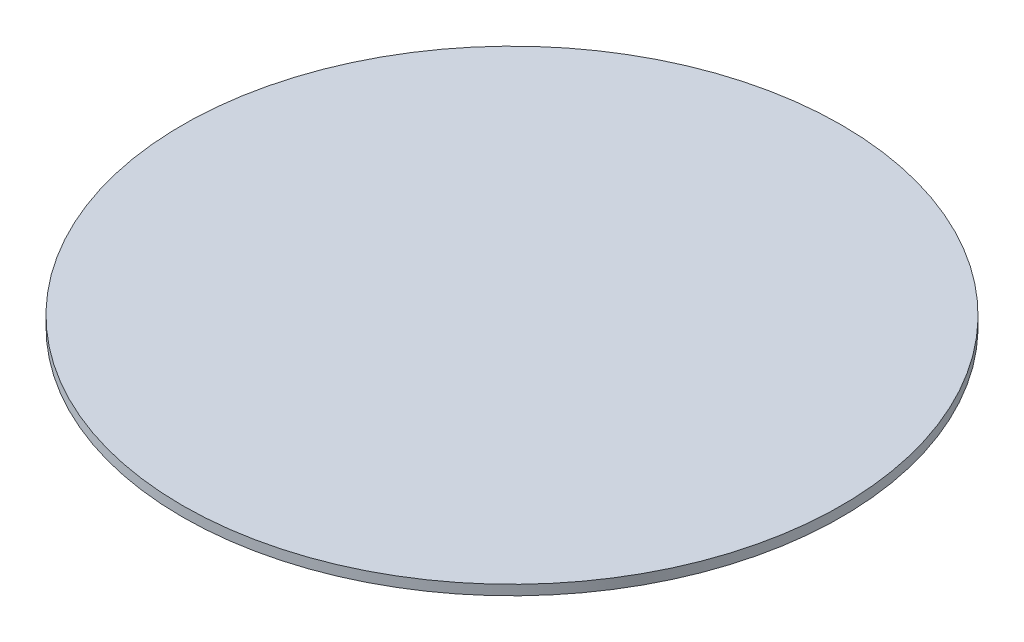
ISO-10303-21;
HEADER;
FILE_DESCRIPTION(('STEP AP214'),'2;1');
FILE_NAME('part.step','',(''),(''),'','','');
FILE_SCHEMA(('AUTOMOTIVE_DESIGN { 1 0 10303 214 1 1 1 1 }'));
ENDSEC;
DATA;
#1=APPLICATION_CONTEXT('core data for automotive mechanical design processes');
#2=APPLICATION_PROTOCOL_DEFINITION('international standard','automotive_design',2000,#1);
#3=PRODUCT_CONTEXT('',#1,'mechanical');
#4=PRODUCT('Part','Part','',(#3));
#5=PRODUCT_RELATED_PRODUCT_CATEGORY('part','',(#4));
#6=PRODUCT_DEFINITION_FORMATION('','',#4);
#7=PRODUCT_DEFINITION_CONTEXT('part definition',#1,'design');
#8=PRODUCT_DEFINITION('design','',#6,#7);
#9=PRODUCT_DEFINITION_SHAPE('','',#8);
#10=(LENGTH_UNIT() NAMED_UNIT(*) SI_UNIT(.MILLI.,.METRE.));
#11=(NAMED_UNIT(*) PLANE_ANGLE_UNIT() SI_UNIT($,.RADIAN.));
#12=(NAMED_UNIT(*) SI_UNIT($,.STERADIAN.) SOLID_ANGLE_UNIT());
#13=UNCERTAINTY_MEASURE_WITH_UNIT(LENGTH_MEASURE(1.E-05),#10,'distance_accuracy_value','');
#14=(GEOMETRIC_REPRESENTATION_CONTEXT(3) GLOBAL_UNCERTAINTY_ASSIGNED_CONTEXT((#13)) GLOBAL_UNIT_ASSIGNED_CONTEXT((#10,
#11,#12)) REPRESENTATION_CONTEXT('',''));
#15=CARTESIAN_POINT('',(0.,0.,0.));
#16=DIRECTION('',(0.,0.,1.));
#17=DIRECTION('',(1.,0.,0.));
#18=AXIS2_PLACEMENT_3D('',#15,#16,#17);
#19=CARTESIAN_POINT('',(0.,25.4,0.));
#20=DIRECTION('',(0.,-1.,0.));
#21=DIRECTION('',(0.,0.,-1.));
#22=AXIS2_PLACEMENT_3D('',#19,#20,#21);
#23=CYLINDRICAL_SURFACE('',#22,838.2);
#24=CARTESIAN_POINT('',(0.,25.4,0.));
#25=DIRECTION('',(0.,1.,0.));
#26=DIRECTION('',(0.,0.,1.));
#27=AXIS2_PLACEMENT_3D('',#24,#25,#26);
#28=CIRCLE('',#27,838.2);
#29=CARTESIAN_POINT('',(0.,25.4,838.2));
#30=VERTEX_POINT('',#29);
#31=EDGE_CURVE('E10',#30,#30,#28,.T.);
#32=ORIENTED_EDGE('',*,*,#31,.F.);
#33=EDGE_LOOP('',(#32));
#34=FACE_BOUND('',#33,.T.);
#35=CARTESIAN_POINT('',(0.,0.,0.));
#36=DIRECTION('',(0.,1.,0.));
#37=DIRECTION('',(0.,0.,1.));
#38=AXIS2_PLACEMENT_3D('',#35,#36,#37);
#39=CIRCLE('',#38,838.2);
#40=CARTESIAN_POINT('',(0.,0.,838.2));
#41=VERTEX_POINT('',#40);
#42=EDGE_CURVE('E30',#41,#41,#39,.T.);
#43=ORIENTED_EDGE('',*,*,#42,.T.);
#44=EDGE_LOOP('',(#43));
#45=FACE_BOUND('',#44,.T.);
#46=ADVANCED_FACE('F24',(#34,#45),#23,.T.);
#47=CARTESIAN_POINT('',(0.,25.4,0.));
#48=DIRECTION('',(0.,1.,0.));
#49=DIRECTION('',(0.,0.,1.));
#50=AXIS2_PLACEMENT_3D('',#47,#48,#49);
#51=PLANE('',#50);
#52=ORIENTED_EDGE('',*,*,#31,.T.);
#53=EDGE_LOOP('',(#52));
#54=FACE_BOUND('',#53,.T.);
#55=ADVANCED_FACE('F39',(#54),#51,.T.);
#56=CARTESIAN_POINT('',(0.,0.,0.));
#57=DIRECTION('',(0.,1.,0.));
#58=DIRECTION('',(0.,0.,1.));
#59=AXIS2_PLACEMENT_3D('',#56,#57,#58);
#60=PLANE('',#59);
#61=ORIENTED_EDGE('',*,*,#42,.F.);
#62=EDGE_LOOP('',(#61));
#63=FACE_BOUND('',#62,.T.);
#64=ADVANCED_FACE('F37',(#63),#60,.F.);
#65=CLOSED_SHELL('',(#46,#55,#64));
#66=MANIFOLD_SOLID_BREP('B2',#65);
#67=ADVANCED_BREP_SHAPE_REPRESENTATION('',(#18,#66),#14);
#68=SHAPE_DEFINITION_REPRESENTATION(#9,#67);
ENDSEC;
END-ISO-10303-21;
